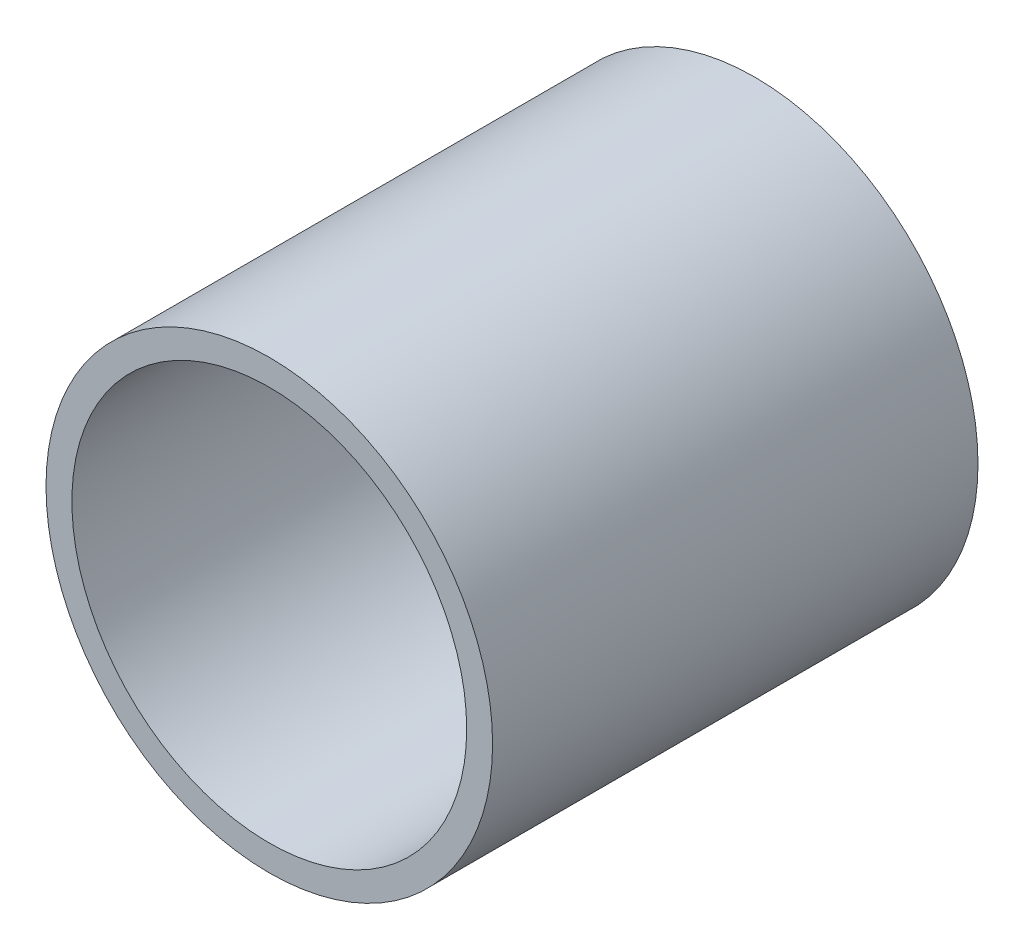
from build123d import *

# Parameters (mm, degrees)
ESQUISSE1_R      = 6.9
ESQUISSE1_R_2    = 6.1
EXTRUSION1_DEPTH = 15


with BuildPart() as part:
    # Esquisse1 → Extrusion1 (new body)
    with BuildSketch(Plane.XY):
        Circle(ESQUISSE1_R)
        Circle(ESQUISSE1_R_2, mode=Mode.SUBTRACT)
    extrude(amount=EXTRUSION1_DEPTH)


solid = part.part
